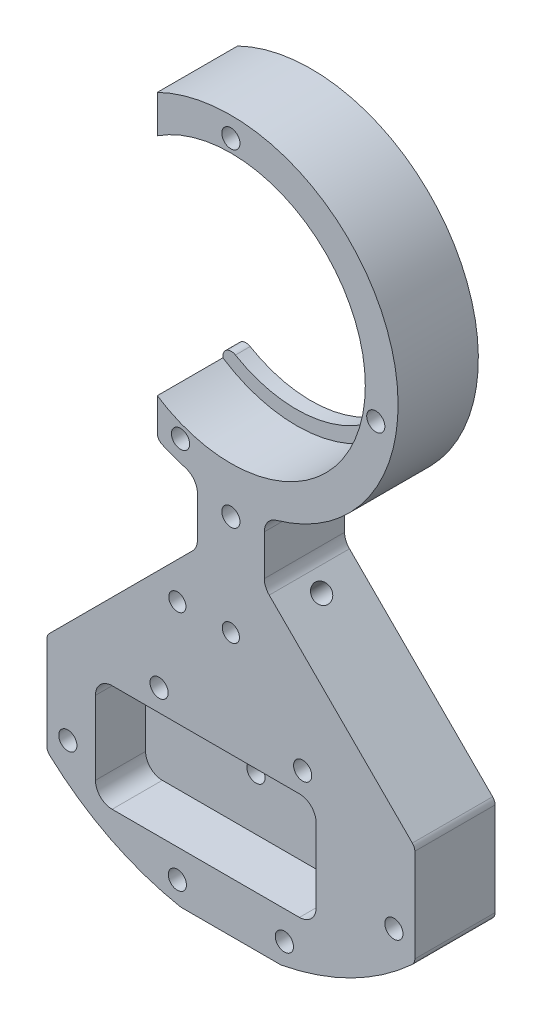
from build123d import *

# Parameters (mm, degrees)
BOSS_EXTRUDE1_DEPTH          = 15.24
SKETCH2_R                    = 22.86
CUT_EXTRUDE1_DEPTH           = 111.046867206
SKETCH3_R                    = 25.527
CUT_EXTRUDE2_DEPTH           = 12.446
F_30_0_1285_DIAMETER_HOLE1_D = 3.2639
F_8_32_TAPPED_HOLE1_D        = 3.4544
F_8_32_TAPPED_HOLE2_D        = 3.4544
FILLET1_R                    = 3.175
SKETCH13_W                   = 28.783433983
SKETCH13_H                   = 77.371667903
CUT_EXTRUDE4_DEPTH           = 111.046867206
F_8_32_TAPPED_HOLE3_D        = 3.4544
SKETCH23_W                   = 41.91
SKETCH23_H                   = 20.32
CUT_EXTRUDE7_DEPTH           = 9.525
FILLET3_R                    = 3.175
CUT_EXTRUDE8_DEPTH           = 2.921
F_8_32_TAPPED_HOLE4_D        = 3.4544
FILLET4_R                    = 0.79375
FILLET5_R                    = 1.5875
F_8_32_TAPPED_HOLE5_D        = 3.4544
F_8_32_TAPPED_HOLE5_DEPTH    = 11.43
F_8_32_TAPPED_HOLE5_TIP      = 1.037806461


with BuildPart() as part:
    # Sketch1 → Boss-Extrude1 (new body)
    with BuildSketch(Plane.XY):
        with BuildLine():
            Line((-6.35, -42.605166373), (-34.925, -71.180166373))
            Line((-34.925, -71.180166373), (-34.925, -90.230166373))
            ThreePointArc((-34.925, -90.230166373), (-23.157252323, -98.55483899), (-9.525, -103.239041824))
            Line((-9.525, -103.239041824), (9.525, -103.239041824))
            ThreePointArc((9.525, -103.239041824), (23.157252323, -98.55483899), (34.925, -90.230166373))
            Line((34.925, -90.230166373), (34.925, -71.180166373))
            Line((34.925, -71.180166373), (6.35, -42.605166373))
            Line((6.35, -42.605166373), (6.35, -31.108519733))
            ThreePointArc((6.35, -31.108519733), (0, 31.75), (-6.35, -31.108519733))
            Line((-6.35, -31.108519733), (-6.35, -42.605166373))
        make_face()
    extrude(amount=-BOSS_EXTRUDE1_DEPTH)

    # Sketch2 → Cut-Extrude1 (cut, through all)
    with BuildSketch(Plane.XY):
        Circle(SKETCH2_R)
    extrude(amount=-CUT_EXTRUDE1_DEPTH, mode=Mode.SUBTRACT)

    # Sketch3 → Cut-Extrude2 (cut)
    with BuildSketch(Plane.XY):
        Circle(SKETCH3_R)
    extrude(amount=-CUT_EXTRUDE2_DEPTH, mode=Mode.SUBTRACT)

    # 30 _0.1285_ Diameter Hole1 (through all)
    with Locations(Plane.XY):
        with Locations((0, -53.34), (-10.16, -53.34)):
            Hole(F_30_0_1285_DIAMETER_HOLE1_D / 2)

    # 8-32 Tapped Hole1 (through all)
    with Locations(Plane.XY):
        with Locations((-13.62993597, -69.215), (-30.95625, -86.54131403), (-10.16, -99.06), (13.62993597, -69.215), (30.95625, -86.54131403), (10.16, -99.06)):
            Hole(F_8_32_TAPPED_HOLE1_D / 2)

    # 8-32 Tapped Hole2 (through all)
    with Locations(Plane.XY):
        with Locations((-9.556042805, -26.255011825), (0, 27.94), (27.515528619, -4.851730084)):
            Hole(F_8_32_TAPPED_HOLE2_D / 2)

    # Fillet1
    fillet1_edges = [part.edges().sort_by_distance(p)[0] for p in [
        (6.35, -31.108519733, -7.62),
        (6.35, -42.605166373, -7.62),
        (-6.35, -42.605166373, -7.62),
        (-6.35, -31.108519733, -7.62),
    ]]
    fillet(fillet1_edges, radius=FILLET1_R)

    # Sketch13 → Cut-Extrude4 (cut, through all)
    with BuildSketch(Plane.XY):
        with Locations((-28.361716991, -3.848805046)):
            Rectangle(SKETCH13_W, SKETCH13_H)
    extrude(amount=-CUT_EXTRUDE4_DEPTH, mode=Mode.SUBTRACT)

    # 8-32 Tapped Hole3 (through all)
    with Locations(Plane.XY):
        with Locations((-4.7625, -83.5025)):
            Hole(F_8_32_TAPPED_HOLE3_D / 2)

    # Sketch23 → Cut-Extrude7 (cut)
    with BuildSketch(Plane.XY):
        with Locations((-4.7625, -83.5025)):
            Rectangle(SKETCH23_W, SKETCH23_H)
    extrude(amount=-CUT_EXTRUDE7_DEPTH, mode=Mode.SUBTRACT)

    # Fillet3
    fillet3_edges = [part.edges().sort_by_distance(p)[0] for p in [
        (16.1925, -73.3425, -4.7625),
        (16.1925, -93.6625, -4.7625),
        (-25.7175, -93.6625, -4.7625),
        (-25.7175, -73.3425, -4.7625),
    ]]
    fillet(fillet3_edges, radius=FILLET3_R)

    # Sketch24 → Cut-Extrude8 (cut)
    with BuildSketch(Plane(origin=(0, 0, -15.24), x_dir=(-1, 0, 0), z_dir=(0, 0, -1))):
        Polygon((-3.81, -28.182041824), (3.81, -28.182041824), (5.5245, -28.182041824), (5.5245, -31.611041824), (3.81, -31.611041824), (-3.81, -31.611041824), (-5.5245, -31.611041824), (-5.5245, -28.182041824), align=None)
    extrude(amount=-CUT_EXTRUDE8_DEPTH, mode=Mode.SUBTRACT)

    # 8-32 Tapped Hole4 (through all)
    with Locations(Plane(origin=(0, 0, -15.24), x_dir=(-1, 0, 0), z_dir=(0, 0, -1))):
        with Locations((0, -34.278041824)):
            Hole(F_8_32_TAPPED_HOLE4_D / 2)

    # Fillet4
    fillet4_edges = [part.edges().sort_by_distance(p)[0] for p in [
        (5.5245, -28.182041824, -13.7795),
        (-5.5245, -28.182041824, -13.7795),
        (-5.5245, -31.611041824, -13.7795),
        (5.5245, -31.611041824, -13.7795),
    ]]
    fillet(fillet4_edges, radius=FILLET4_R)

    # Fillet5
    fillet5_edges = [part.edges().sort_by_distance(p)[0] for p in [
        (-13.97, -28.511429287, -7.62),
        (-13.97, 18.094714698, -13.843),
        (-13.97, -18.094714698, -13.843),
        (34.925, -71.180166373, -7.62),
        (34.925, -90.230166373, -7.62),
        (9.525, -103.239041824, -7.62),
        (-9.525, -103.239041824, -7.62),
        (-34.925, -90.230166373, -7.62),
        (-34.925, -71.180166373, -7.62),
    ]]
    fillet(fillet5_edges, radius=FILLET5_R)

    # 8-32 Tapped Hole5
    with Locations(Plane(origin=(-18.127583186, -18.127583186, 0), x_dir=(-0.7071067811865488, 0.7071067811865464, 0), z_dir=(0.7071067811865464, 0.7071067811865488, 0))):
        with Locations((-39.233658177, -7.62)):
            Hole(F_8_32_TAPPED_HOLE5_D / 2, depth=F_8_32_TAPPED_HOLE5_DEPTH)
            with Locations((0, 0, -(F_8_32_TAPPED_HOLE5_DEPTH + F_8_32_TAPPED_HOLE5_TIP / 2))):  # 118° drill point
                Cone(0, F_8_32_TAPPED_HOLE5_D / 2, F_8_32_TAPPED_HOLE5_TIP, mode=Mode.SUBTRACT)


solid = part.part
